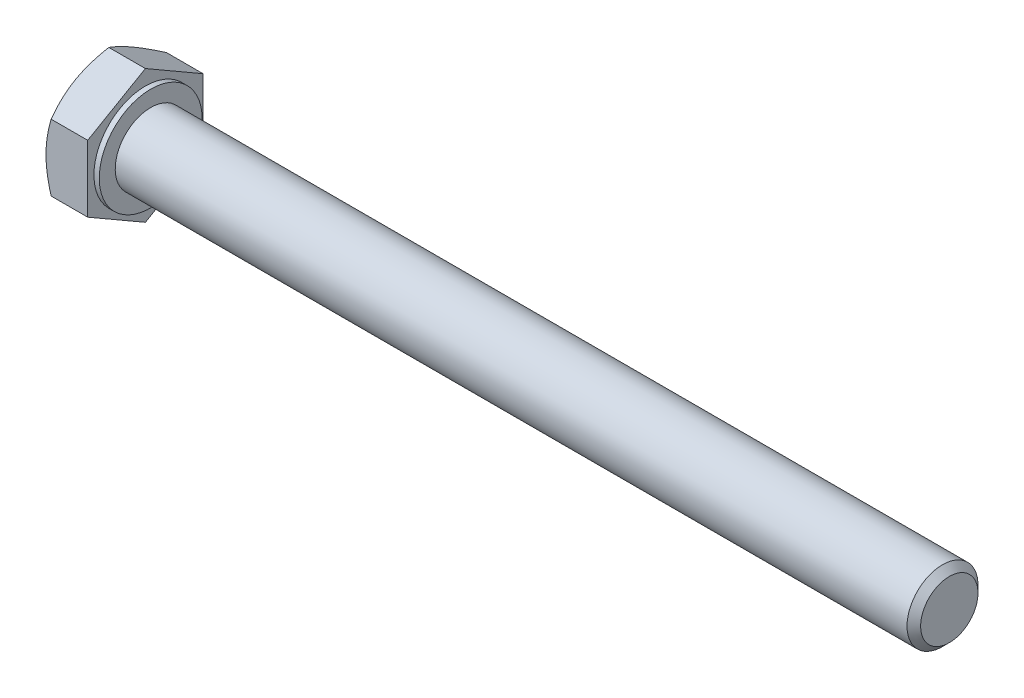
ISO-10303-21;
HEADER;
FILE_DESCRIPTION(('STEP AP214'),'2;1');
FILE_NAME('part.step','',(''),(''),'','','');
FILE_SCHEMA(('AUTOMOTIVE_DESIGN { 1 0 10303 214 1 1 1 1 }'));
ENDSEC;
DATA;
#1=APPLICATION_CONTEXT('core data for automotive mechanical design processes');
#2=APPLICATION_PROTOCOL_DEFINITION('international standard','automotive_design',2000,#1);
#3=PRODUCT_CONTEXT('',#1,'mechanical');
#4=PRODUCT('Part','Part','',(#3));
#5=PRODUCT_RELATED_PRODUCT_CATEGORY('part','',(#4));
#6=PRODUCT_DEFINITION_FORMATION('','',#4);
#7=PRODUCT_DEFINITION_CONTEXT('part definition',#1,'design');
#8=PRODUCT_DEFINITION('design','',#6,#7);
#9=PRODUCT_DEFINITION_SHAPE('','',#8);
#10=(LENGTH_UNIT() NAMED_UNIT(*) SI_UNIT(.MILLI.,.METRE.));
#11=(NAMED_UNIT(*) PLANE_ANGLE_UNIT() SI_UNIT($,.RADIAN.));
#12=(NAMED_UNIT(*) SI_UNIT($,.STERADIAN.) SOLID_ANGLE_UNIT());
#13=UNCERTAINTY_MEASURE_WITH_UNIT(LENGTH_MEASURE(1.E-05),#10,'distance_accuracy_value','');
#14=(GEOMETRIC_REPRESENTATION_CONTEXT(3) GLOBAL_UNCERTAINTY_ASSIGNED_CONTEXT((#13)) GLOBAL_UNIT_ASSIGNED_CONTEXT((#10,
#11,#12)) REPRESENTATION_CONTEXT('',''));
#15=CARTESIAN_POINT('',(0.,0.,0.));
#16=DIRECTION('',(0.,0.,1.));
#17=DIRECTION('',(1.,0.,0.));
#18=AXIS2_PLACEMENT_3D('',#15,#16,#17);
#19=CARTESIAN_POINT('',(-5.30009999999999,0.,0.));
#20=DIRECTION('',(1.,0.,0.));
#21=DIRECTION('',(0.,0.,-1.));
#22=AXIS2_PLACEMENT_3D('',#19,#20,#21);
#23=PLANE('',#22);
#24=CARTESIAN_POINT('',(-5.30010000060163,0.,0.));
#25=DIRECTION('',(1.,0.,0.));
#26=DIRECTION('',(0.,0.,-1.));
#27=AXIS2_PLACEMENT_3D('',#24,#25,#26);
#28=CIRCLE('',#27,6.50000000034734);
#29=CARTESIAN_POINT('',(-5.3001000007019,5.62916512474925,-3.25000000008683));
#30=VERTEX_POINT('',#29);
#31=CARTESIAN_POINT('',(-5.3001000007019,5.62916512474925,3.25000000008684));
#32=VERTEX_POINT('',#31);
#33=EDGE_CURVE('E323',#30,#32,#28,.T.);
#34=ORIENTED_EDGE('',*,*,#33,.F.);
#35=CARTESIAN_POINT('',(-5.30010000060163,0.,0.));
#36=DIRECTION('',(1.,0.,0.));
#37=DIRECTION('',(0.,0.,-1.));
#38=AXIS2_PLACEMENT_3D('',#35,#36,#37);
#39=CIRCLE('',#38,6.50000000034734);
#40=CARTESIAN_POINT('',(-5.3001000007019,0.,-6.50000000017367));
#41=VERTEX_POINT('',#40);
#42=EDGE_CURVE('E319',#41,#30,#39,.T.);
#43=ORIENTED_EDGE('',*,*,#42,.F.);
#44=CARTESIAN_POINT('',(-5.30010000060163,0.,0.));
#45=DIRECTION('',(1.,0.,0.));
#46=DIRECTION('',(0.,0.,-1.));
#47=AXIS2_PLACEMENT_3D('',#44,#45,#46);
#48=CIRCLE('',#47,6.50000000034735);
#49=CARTESIAN_POINT('',(-5.3001000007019,-5.62916512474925,-3.25000000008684));
#50=VERTEX_POINT('',#49);
#51=EDGE_CURVE('E315',#50,#41,#48,.T.);
#52=ORIENTED_EDGE('',*,*,#51,.F.);
#53=CARTESIAN_POINT('',(-5.30010000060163,0.,0.));
#54=DIRECTION('',(1.,0.,0.));
#55=DIRECTION('',(0.,0.,-1.));
#56=AXIS2_PLACEMENT_3D('',#53,#54,#55);
#57=CIRCLE('',#56,6.50000000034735);
#58=CARTESIAN_POINT('',(-5.3001000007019,-5.62916512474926,3.25000000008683));
#59=VERTEX_POINT('',#58);
#60=EDGE_CURVE('E90',#59,#50,#57,.T.);
#61=ORIENTED_EDGE('',*,*,#60,.F.);
#62=CARTESIAN_POINT('',(-5.30010000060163,0.,0.));
#63=DIRECTION('',(1.,0.,0.));
#64=DIRECTION('',(0.,0.,-1.));
#65=AXIS2_PLACEMENT_3D('',#62,#63,#64);
#66=CIRCLE('',#65,6.50000000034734);
#67=CARTESIAN_POINT('',(-5.3001000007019,0.,6.50000000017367));
#68=VERTEX_POINT('',#67);
#69=EDGE_CURVE('E87',#68,#59,#66,.T.);
#70=ORIENTED_EDGE('',*,*,#69,.F.);
#71=CARTESIAN_POINT('',(-5.30010000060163,0.,0.));
#72=DIRECTION('',(1.,0.,0.));
#73=DIRECTION('',(0.,0.,-1.));
#74=AXIS2_PLACEMENT_3D('',#71,#72,#73);
#75=CIRCLE('',#74,6.50000000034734);
#76=EDGE_CURVE('E19',#32,#68,#75,.T.);
#77=ORIENTED_EDGE('',*,*,#76,.F.);
#78=EDGE_LOOP('',(#34,#43,#52,#61,#70,#77));
#79=FACE_BOUND('',#78,.T.);
#80=ADVANCED_FACE('F16',(#79),#23,.F.);
#81=CARTESIAN_POINT('',(-4.71606007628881,0.,0.));
#82=DIRECTION('',(1.,0.,0.));
#83=DIRECTION('',(0.,0.,-1.));
#84=AXIS2_PLACEMENT_3D('',#81,#82,#83);
#85=CONICAL_SURFACE('',#84,7.51158682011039,1.04719755);
#86=ORIENTED_EDGE('',*,*,#76,.T.);
#87=CARTESIAN_POINT('',(-4.71954341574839,3.75277674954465,6.50000000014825));
#88=CARTESIAN_POINT('',(-4.80774841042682,3.44730232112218,6.50000000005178));
#89=CARTESIAN_POINT('',(-4.88855958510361,3.13938154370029,6.50000000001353));
#90=CARTESIAN_POINT('',(-5.03106863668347,2.52082569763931,6.49999999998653));
#91=CARTESIAN_POINT('',(-5.09286102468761,2.2102122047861,6.49999999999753));
#92=CARTESIAN_POINT('',(-5.16873158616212,1.74136052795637,6.50000000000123));
#93=CARTESIAN_POINT('',(-5.19122798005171,1.58448437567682,6.50000000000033));
#94=CARTESIAN_POINT('',(-5.23016970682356,1.26998104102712,6.49999999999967));
#95=CARTESIAN_POINT('',(-5.24661519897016,1.11235387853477,6.4999999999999));
#96=CARTESIAN_POINT('',(-5.27316617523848,0.795765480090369,6.50000000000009));
#97=CARTESIAN_POINT('',(-5.28323941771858,0.636801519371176,6.50000000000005));
#98=CARTESIAN_POINT('',(-5.29672027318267,0.31856096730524,6.49999999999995));
#99=CARTESIAN_POINT('',(-5.30012656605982,0.159284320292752,6.4999999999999));
#100=CARTESIAN_POINT('',(-5.30010000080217,1.44683826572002E-11,6.5));
#101=B_SPLINE_CURVE_WITH_KNOTS('',3,(#87,#88,#89,#90,#91,#92,#93,#94,#95,#96,#97,#98,#99,#100),
.UNSPECIFIED.,.F.,.F.,(4,2,2,2,2,2,4),(0.,0.95424765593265,1.90367376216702,2.37900973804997,
2.85433320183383,3.33204281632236,3.80984701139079),.UNSPECIFIED.);
#102=CARTESIAN_POINT('',(-4.71954341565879,3.75277674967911,6.49999999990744));
#103=VERTEX_POINT('',#102);
#104=EDGE_CURVE('E108',#103,#68,#101,.T.);
#105=ORIENTED_EDGE('',*,*,#104,.F.);
#106=CARTESIAN_POINT('',(-5.30010000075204,5.62916512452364,3.24999999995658));
#107=CARTESIAN_POINT('',(-5.30012656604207,5.54952296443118,3.38794426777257));
#108=CARTESIAN_POINT('',(-5.29672027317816,5.4698846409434,3.52588189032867));
#109=CARTESIAN_POINT('',(-5.28323941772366,5.31076436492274,3.80148629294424));
#110=CARTESIAN_POINT('',(-5.27316617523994,5.231282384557,3.93915312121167));
#111=CARTESIAN_POINT('',(-5.24661519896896,5.07298818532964,4.21332671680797));
#112=CARTESIAN_POINT('',(-5.23016970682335,4.99417460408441,4.34983584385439));
#113=CARTESIAN_POINT('',(-5.19122798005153,4.8369229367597,4.62220372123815));
#114=CARTESIAN_POINT('',(-5.16873158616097,4.75848486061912,4.75806245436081));
#115=CARTESIAN_POINT('',(-5.09286102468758,4.52405902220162,5.16409991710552));
#116=CARTESIAN_POINT('',(-5.03106863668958,4.36875227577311,5.43309909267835));
#117=CARTESIAN_POINT('',(-4.88855958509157,4.059474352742,5.96878416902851));
#118=CARTESIAN_POINT('',(-4.80774841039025,3.90551396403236,6.23545138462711));
#119=CARTESIAN_POINT('',(-4.71954341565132,3.7527767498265,6.49999999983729));
#120=B_SPLINE_CURVE_WITH_KNOTS('',3,(#106,#107,#108,#109,#110,#111,#112,#113,#114,#115,#116,
#117,#118,#119),.UNSPECIFIED.,.F.,.F.,(4,2,2,2,2,2,4),(0.,0.477804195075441,0.955513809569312,
1.43083727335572,1.90617324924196,2.85559935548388,3.80984701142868),.UNSPECIFIED.);
#121=EDGE_CURVE('E102',#32,#103,#120,.T.);
#122=ORIENTED_EDGE('',*,*,#121,.F.);
#123=EDGE_LOOP('',(#86,#105,#122));
#124=FACE_BOUND('',#123,.T.);
#125=ADVANCED_FACE('F107',(#124),#85,.T.);
#126=CARTESIAN_POINT('',(-4.71606007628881,0.,0.));
#127=DIRECTION('',(1.,0.,0.));
#128=DIRECTION('',(0.,0.,-1.));
#129=AXIS2_PLACEMENT_3D('',#126,#127,#128);
#130=CONICAL_SURFACE('',#129,7.51158682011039,1.04719755);
#131=CARTESIAN_POINT('',(-5.30010000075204,0.,6.49999999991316));
#132=CARTESIAN_POINT('',(-5.30012656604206,-0.159284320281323,6.49999999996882));
#133=CARTESIAN_POINT('',(-5.29672027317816,-0.318560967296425,6.49999999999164));
#134=CARTESIAN_POINT('',(-5.28323941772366,-0.636801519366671,6.50000000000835));
#135=CARTESIAN_POINT('',(-5.27316617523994,-0.795765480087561,6.50000000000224));
#136=CARTESIAN_POINT('',(-5.24661519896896,-1.11235387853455,6.49999999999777));
#137=CARTESIAN_POINT('',(-5.23016970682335,-1.26998104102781,6.49999999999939));
#138=CARTESIAN_POINT('',(-5.19122798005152,-1.58448437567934,6.50000000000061));
#139=CARTESIAN_POINT('',(-5.16873158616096,-1.74136052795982,6.50000000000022));
#140=CARTESIAN_POINT('',(-5.09286102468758,-2.21021220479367,6.49999999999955));
#141=CARTESIAN_POINT('',(-5.03106863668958,-2.52082569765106,6.49999999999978));
#142=CARTESIAN_POINT('',(-4.88855958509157,-3.13938154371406,6.50000000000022));
#143=CARTESIAN_POINT('',(-4.80774841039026,-3.44730232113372,6.50000000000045));
#144=CARTESIAN_POINT('',(-4.71954341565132,-3.75277674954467,6.5));
#145=B_SPLINE_CURVE_WITH_KNOTS('',3,(#131,#132,#133,#134,#135,#136,#137,#138,#139,#140,#141,
#142,#143,#144),.UNSPECIFIED.,.F.,.F.,(4,2,2,2,2,2,4),(0.,0.477804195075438,0.955513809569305,
1.43083727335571,1.90617324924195,2.85559935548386,3.80984701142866),.UNSPECIFIED.);
#146=CARTESIAN_POINT('',(-4.71954341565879,-3.75277674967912,6.49999999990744));
#147=VERTEX_POINT('',#146);
#148=EDGE_CURVE('E95',#68,#147,#145,.T.);
#149=ORIENTED_EDGE('',*,*,#148,.F.);
#150=ORIENTED_EDGE('',*,*,#69,.T.);
#151=CARTESIAN_POINT('',(-4.71954341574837,-3.75277674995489,6.49999999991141));
#152=CARTESIAN_POINT('',(-4.80774841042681,-3.90551396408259,6.23545138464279));
#153=CARTESIAN_POINT('',(-4.8885595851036,-4.05947435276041,5.96878416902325));
#154=CARTESIAN_POINT('',(-5.03106863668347,-4.36875227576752,5.43309909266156));
#155=CARTESIAN_POINT('',(-5.09286102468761,-4.52405902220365,5.16409991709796));
#156=CARTESIAN_POINT('',(-5.16873158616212,-4.75848486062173,4.75806245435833));
#157=CARTESIAN_POINT('',(-5.19122798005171,-4.83692293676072,4.62220372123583));
#158=CARTESIAN_POINT('',(-5.23016970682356,-4.99417460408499,4.34983584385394));
#159=CARTESIAN_POINT('',(-5.24661519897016,-5.07298818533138,4.21332671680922));
#160=CARTESIAN_POINT('',(-5.27316617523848,-5.23128238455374,3.93915312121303));
#161=CARTESIAN_POINT('',(-5.28323941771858,-5.3107643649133,3.80148629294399));
#162=CARTESIAN_POINT('',(-5.29672027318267,-5.46988464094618,3.52588189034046));
#163=CARTESIAN_POINT('',(-5.30012656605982,-5.54952296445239,3.38794426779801));
#164=CARTESIAN_POINT('',(-5.30010000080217,-5.62916512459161,3.25000000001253));
#165=B_SPLINE_CURVE_WITH_KNOTS('',3,(#151,#152,#153,#154,#155,#156,#157,#158,#159,#160,#161,
#162,#163,#164),.UNSPECIFIED.,.F.,.F.,(4,2,2,2,2,2,4),(0.,0.954247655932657,1.90367376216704,
2.37900973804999,2.85433320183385,3.33204281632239,3.80984701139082),.UNSPECIFIED.);
#166=EDGE_CURVE('E97',#147,#59,#165,.T.);
#167=ORIENTED_EDGE('',*,*,#166,.F.);
#168=EDGE_LOOP('',(#149,#150,#167));
#169=FACE_BOUND('',#168,.T.);
#170=ADVANCED_FACE('F96',(#169),#130,.T.);
#171=CARTESIAN_POINT('',(-4.71606007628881,0.,0.));
#172=DIRECTION('',(1.,0.,0.));
#173=DIRECTION('',(0.,0.,-1.));
#174=AXIS2_PLACEMENT_3D('',#171,#172,#173);
#175=CONICAL_SURFACE('',#174,7.51158682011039,1.04719755);
#176=CARTESIAN_POINT('',(-5.30010000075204,-5.62916512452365,3.24999999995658));
#177=CARTESIAN_POINT('',(-5.30012656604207,-5.7088072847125,3.11205573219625));
#178=CARTESIAN_POINT('',(-5.29672027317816,-5.78844560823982,2.97411810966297));
#179=CARTESIAN_POINT('',(-5.28323941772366,-5.94756588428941,2.69851370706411));
#180=CARTESIAN_POINT('',(-5.27316617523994,-6.02704786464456,2.56084687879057));
#181=CARTESIAN_POINT('',(-5.24661519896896,-6.18534206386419,2.28667328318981));
#182=CARTESIAN_POINT('',(-5.23016970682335,-6.26415564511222,2.150164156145));
#183=CARTESIAN_POINT('',(-5.19122798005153,-6.42140731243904,1.87779627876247));
#184=CARTESIAN_POINT('',(-5.16873158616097,-6.49984538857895,1.74193754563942));
#185=CARTESIAN_POINT('',(-5.09286102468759,-6.7342712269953,1.33590008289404));
#186=CARTESIAN_POINT('',(-5.03106863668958,-6.88957797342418,1.06690090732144));
#187=CARTESIAN_POINT('',(-4.88855958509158,-7.19885589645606,0.531215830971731));
#188=CARTESIAN_POINT('',(-4.80774841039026,-7.35281628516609,0.264548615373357));
#189=CARTESIAN_POINT('',(-4.71954341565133,-7.50555349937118,1.6272616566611E-10));
#190=B_SPLINE_CURVE_WITH_KNOTS('',3,(#176,#177,#178,#179,#180,#181,#182,#183,#184,#185,#186,
#187,#188,#189),.UNSPECIFIED.,.F.,.F.,(4,2,2,2,2,2,4),(0.,0.477804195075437,0.955513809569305,
1.43083727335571,1.90617324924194,2.85559935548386,3.80984701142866),.UNSPECIFIED.);
#191=CARTESIAN_POINT('',(-4.71954341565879,-7.50555349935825,0.));
#192=VERTEX_POINT('',#191);
#193=EDGE_CURVE('E113',#59,#192,#190,.T.);
#194=ORIENTED_EDGE('',*,*,#193,.F.);
#195=ORIENTED_EDGE('',*,*,#60,.T.);
#196=CARTESIAN_POINT('',(-4.71954341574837,-7.50555349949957,-2.36832132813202E-10));
#197=CARTESIAN_POINT('',(-4.80774841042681,-7.3528162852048,-0.264548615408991));
#198=CARTESIAN_POINT('',(-4.8885595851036,-7.19885589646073,-0.531215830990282));
#199=CARTESIAN_POINT('',(-5.03106863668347,-6.88957797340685,-1.06690090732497));
#200=CARTESIAN_POINT('',(-5.09286102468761,-6.73427122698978,-1.33590008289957));
#201=CARTESIAN_POINT('',(-5.16873158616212,-6.49984538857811,-1.7419375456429));
#202=CARTESIAN_POINT('',(-5.19122798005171,-6.42140731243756,-1.8777962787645));
#203=CARTESIAN_POINT('',(-5.23016970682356,-6.26415564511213,-2.15016415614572));
#204=CARTESIAN_POINT('',(-5.24661519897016,-6.18534206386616,-2.28667328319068));
#205=CARTESIAN_POINT('',(-5.27316617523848,-6.02704786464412,-2.56084687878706));
#206=CARTESIAN_POINT('',(-5.28323941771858,-5.94756588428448,-2.69851370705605));
#207=CARTESIAN_POINT('',(-5.29672027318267,-5.78844560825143,-2.97411810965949));
#208=CARTESIAN_POINT('',(-5.30012656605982,-5.70880728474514,-3.11205573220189));
#209=CARTESIAN_POINT('',(-5.30010000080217,-5.62916512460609,-3.24999999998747));
#210=B_SPLINE_CURVE_WITH_KNOTS('',3,(#196,#197,#198,#199,#200,#201,#202,#203,#204,#205,#206,
#207,#208,#209),.UNSPECIFIED.,.F.,.F.,(4,2,2,2,2,2,4),(0.,0.954247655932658,1.90367376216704,
2.37900973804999,2.85433320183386,3.33204281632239,3.80984701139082),.UNSPECIFIED.);
#211=EDGE_CURVE('E207',#192,#50,#210,.T.);
#212=ORIENTED_EDGE('',*,*,#211,.F.);
#213=EDGE_LOOP('',(#194,#195,#212));
#214=FACE_BOUND('',#213,.T.);
#215=ADVANCED_FACE('F215',(#214),#175,.T.);
#216=CARTESIAN_POINT('',(-4.71606007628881,0.,0.));
#217=DIRECTION('',(1.,0.,0.));
#218=DIRECTION('',(0.,0.,-1.));
#219=AXIS2_PLACEMENT_3D('',#216,#217,#218);
#220=CONICAL_SURFACE('',#219,7.51158682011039,1.04719755);
#221=CARTESIAN_POINT('',(-5.30010000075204,-5.62916512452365,-3.24999999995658));
#222=CARTESIAN_POINT('',(-5.30012656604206,-5.54952296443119,-3.38794426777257));
#223=CARTESIAN_POINT('',(-5.29672027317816,-5.46988464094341,-3.52588189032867));
#224=CARTESIAN_POINT('',(-5.28323941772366,-5.31076436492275,-3.80148629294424));
#225=CARTESIAN_POINT('',(-5.27316617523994,-5.23128238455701,-3.93915312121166));
#226=CARTESIAN_POINT('',(-5.24661519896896,-5.07298818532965,-4.21332671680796));
#227=CARTESIAN_POINT('',(-5.23016970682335,-4.99417460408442,-4.34983584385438));
#228=CARTESIAN_POINT('',(-5.19122798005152,-4.83692293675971,-4.62220372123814));
#229=CARTESIAN_POINT('',(-5.16873158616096,-4.75848486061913,-4.7580624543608));
#230=CARTESIAN_POINT('',(-5.09286102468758,-4.52405902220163,-5.16409991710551));
#231=CARTESIAN_POINT('',(-5.03106863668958,-4.36875227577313,-5.43309909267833));
#232=CARTESIAN_POINT('',(-4.88855958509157,-4.05947435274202,-5.96878416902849));
#233=CARTESIAN_POINT('',(-4.80774841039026,-3.90551396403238,-6.23545138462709));
#234=CARTESIAN_POINT('',(-4.71954341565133,-3.75277674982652,-6.49999999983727));
#235=B_SPLINE_CURVE_WITH_KNOTS('',3,(#221,#222,#223,#224,#225,#226,#227,#228,#229,#230,#231,
#232,#233,#234),.UNSPECIFIED.,.F.,.F.,(4,2,2,2,2,2,4),(0.,0.477804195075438,0.955513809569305,
1.43083727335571,1.90617324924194,2.85559935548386,3.80984701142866),.UNSPECIFIED.);
#236=CARTESIAN_POINT('',(-4.71954341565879,-3.75277674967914,-6.49999999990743));
#237=VERTEX_POINT('',#236);
#238=EDGE_CURVE('E219',#50,#237,#235,.T.);
#239=ORIENTED_EDGE('',*,*,#238,.F.);
#240=ORIENTED_EDGE('',*,*,#51,.T.);
#241=CARTESIAN_POINT('',(-4.71954341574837,-3.75277674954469,-6.50000000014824));
#242=CARTESIAN_POINT('',(-4.8077484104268,-3.44730232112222,-6.50000000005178));
#243=CARTESIAN_POINT('',(-4.8885595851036,-3.13938154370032,-6.50000000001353));
#244=CARTESIAN_POINT('',(-5.03106863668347,-2.52082569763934,-6.49999999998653));
#245=CARTESIAN_POINT('',(-5.09286102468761,-2.21021220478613,-6.49999999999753));
#246=CARTESIAN_POINT('',(-5.16873158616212,-1.74136052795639,-6.50000000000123));
#247=CARTESIAN_POINT('',(-5.19122798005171,-1.58448437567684,-6.50000000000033));
#248=CARTESIAN_POINT('',(-5.23016970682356,-1.26998104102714,-6.49999999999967));
#249=CARTESIAN_POINT('',(-5.24661519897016,-1.11235387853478,-6.4999999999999));
#250=CARTESIAN_POINT('',(-5.27316617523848,-0.795765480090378,-6.50000000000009));
#251=CARTESIAN_POINT('',(-5.28323941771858,-0.636801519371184,-6.50000000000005));
#252=CARTESIAN_POINT('',(-5.29672027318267,-0.318560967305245,-6.49999999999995));
#253=CARTESIAN_POINT('',(-5.30012656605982,-0.159284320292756,-6.4999999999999));
#254=CARTESIAN_POINT('',(-5.30010000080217,-1.4470694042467E-11,-6.5));
#255=B_SPLINE_CURVE_WITH_KNOTS('',3,(#241,#242,#243,#244,#245,#246,#247,#248,#249,#250,#251,
#252,#253,#254),.UNSPECIFIED.,.F.,.F.,(4,2,2,2,2,2,4),(0.,0.954247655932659,1.90367376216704,
2.37900973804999,2.85433320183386,3.3320428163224,3.80984701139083),.UNSPECIFIED.);
#256=EDGE_CURVE('E201',#237,#41,#255,.T.);
#257=ORIENTED_EDGE('',*,*,#256,.F.);
#258=EDGE_LOOP('',(#239,#240,#257));
#259=FACE_BOUND('',#258,.T.);
#260=ADVANCED_FACE('F212',(#259),#220,.T.);
#261=CARTESIAN_POINT('',(-4.71606007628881,0.,0.));
#262=DIRECTION('',(1.,0.,0.));
#263=DIRECTION('',(0.,0.,-1.));
#264=AXIS2_PLACEMENT_3D('',#261,#262,#263);
#265=CONICAL_SURFACE('',#264,7.51158682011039,1.04719755);
#266=ORIENTED_EDGE('',*,*,#42,.T.);
#267=CARTESIAN_POINT('',(-4.71954341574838,3.75277674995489,-6.49999999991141));
#268=CARTESIAN_POINT('',(-4.80774841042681,3.90551396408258,-6.23545138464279));
#269=CARTESIAN_POINT('',(-4.8885595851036,4.05947435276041,-5.96878416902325));
#270=CARTESIAN_POINT('',(-5.03106863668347,4.36875227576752,-5.43309909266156));
#271=CARTESIAN_POINT('',(-5.09286102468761,4.52405902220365,-5.16409991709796));
#272=CARTESIAN_POINT('',(-5.16873158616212,4.75848486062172,-4.75806245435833));
#273=CARTESIAN_POINT('',(-5.19122798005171,4.83692293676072,-4.62220372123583));
#274=CARTESIAN_POINT('',(-5.23016970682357,4.99417460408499,-4.34983584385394));
#275=CARTESIAN_POINT('',(-5.24661519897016,5.07298818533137,-4.21332671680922));
#276=CARTESIAN_POINT('',(-5.27316617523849,5.23128238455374,-3.93915312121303));
#277=CARTESIAN_POINT('',(-5.28323941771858,5.3107643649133,-3.80148629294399));
#278=CARTESIAN_POINT('',(-5.29672027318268,5.46988464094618,-3.52588189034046));
#279=CARTESIAN_POINT('',(-5.30012656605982,5.54952296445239,-3.38794426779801));
#280=CARTESIAN_POINT('',(-5.30010000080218,5.62916512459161,-3.25000000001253));
#281=B_SPLINE_CURVE_WITH_KNOTS('',3,(#267,#268,#269,#270,#271,#272,#273,#274,#275,#276,#277,
#278,#279,#280),.UNSPECIFIED.,.F.,.F.,(4,2,2,2,2,2,4),(0.,0.954247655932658,1.90367376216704,
2.37900973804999,2.85433320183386,3.3320428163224,3.80984701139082),.UNSPECIFIED.);
#282=CARTESIAN_POINT('',(-4.71954341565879,3.75277674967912,-6.49999999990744));
#283=VERTEX_POINT('',#282);
#284=EDGE_CURVE('E173',#283,#30,#281,.T.);
#285=ORIENTED_EDGE('',*,*,#284,.F.);
#286=CARTESIAN_POINT('',(-5.30010000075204,0.,-6.49999999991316));
#287=CARTESIAN_POINT('',(-5.30012656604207,0.15928432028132,-6.49999999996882));
#288=CARTESIAN_POINT('',(-5.29672027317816,0.318560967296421,-6.49999999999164));
#289=CARTESIAN_POINT('',(-5.28323941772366,0.636801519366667,-6.50000000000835));
#290=CARTESIAN_POINT('',(-5.27316617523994,0.795765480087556,-6.50000000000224));
#291=CARTESIAN_POINT('',(-5.24661519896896,1.11235387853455,-6.49999999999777));
#292=CARTESIAN_POINT('',(-5.23016970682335,1.26998104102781,-6.49999999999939));
#293=CARTESIAN_POINT('',(-5.19122798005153,1.58448437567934,-6.50000000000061));
#294=CARTESIAN_POINT('',(-5.16873158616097,1.74136052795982,-6.50000000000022));
#295=CARTESIAN_POINT('',(-5.09286102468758,2.21021220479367,-6.49999999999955));
#296=CARTESIAN_POINT('',(-5.03106863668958,2.52082569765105,-6.49999999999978));
#297=CARTESIAN_POINT('',(-4.88855958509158,3.13938154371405,-6.50000000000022));
#298=CARTESIAN_POINT('',(-4.80774841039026,3.44730232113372,-6.50000000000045));
#299=CARTESIAN_POINT('',(-4.71954341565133,3.75277674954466,-6.5));
#300=B_SPLINE_CURVE_WITH_KNOTS('',3,(#286,#287,#288,#289,#290,#291,#292,#293,#294,#295,#296,
#297,#298,#299),.UNSPECIFIED.,.F.,.F.,(4,2,2,2,2,2,4),(0.,0.477804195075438,0.955513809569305,
1.43083727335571,1.90617324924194,2.85559935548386,3.80984701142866),.UNSPECIFIED.);
#301=EDGE_CURVE('E196',#41,#283,#300,.T.);
#302=ORIENTED_EDGE('',*,*,#301,.F.);
#303=EDGE_LOOP('',(#266,#285,#302));
#304=FACE_BOUND('',#303,.T.);
#305=ADVANCED_FACE('F158',(#304),#265,.T.);
#306=CARTESIAN_POINT('',(-4.71606007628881,0.,0.));
#307=DIRECTION('',(1.,0.,0.));
#308=DIRECTION('',(0.,0.,-1.));
#309=AXIS2_PLACEMENT_3D('',#306,#307,#308);
#310=CONICAL_SURFACE('',#309,7.51158682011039,1.04719755);
#311=ORIENTED_EDGE('',*,*,#33,.T.);
#312=CARTESIAN_POINT('',(-4.71954341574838,7.50555349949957,2.36845423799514E-10));
#313=CARTESIAN_POINT('',(-4.80774841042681,7.3528162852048,0.264548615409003));
#314=CARTESIAN_POINT('',(-4.8885595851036,7.19885589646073,0.531215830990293));
#315=CARTESIAN_POINT('',(-5.03106863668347,6.88957797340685,1.06690090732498));
#316=CARTESIAN_POINT('',(-5.09286102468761,6.73427122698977,1.33590008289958));
#317=CARTESIAN_POINT('',(-5.16873158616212,6.49984538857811,1.74193754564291));
#318=CARTESIAN_POINT('',(-5.19122798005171,6.42140731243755,1.8777962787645));
#319=CARTESIAN_POINT('',(-5.23016970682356,6.26415564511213,2.15016415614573));
#320=CARTESIAN_POINT('',(-5.24661519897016,6.18534206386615,2.28667328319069));
#321=CARTESIAN_POINT('',(-5.27316617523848,6.02704786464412,2.56084687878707));
#322=CARTESIAN_POINT('',(-5.28323941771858,5.94756588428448,2.69851370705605));
#323=CARTESIAN_POINT('',(-5.29672027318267,5.78844560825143,2.97411810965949));
#324=CARTESIAN_POINT('',(-5.30012656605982,5.70880728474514,3.11205573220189));
#325=CARTESIAN_POINT('',(-5.30010000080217,5.62916512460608,3.24999999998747));
#326=B_SPLINE_CURVE_WITH_KNOTS('',3,(#312,#313,#314,#315,#316,#317,#318,#319,#320,#321,#322,
#323,#324,#325),.UNSPECIFIED.,.F.,.F.,(4,2,2,2,2,2,4),(0.,0.954247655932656,1.90367376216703,
2.37900973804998,2.85433320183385,3.33204281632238,3.80984701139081),.UNSPECIFIED.);
#327=CARTESIAN_POINT('',(-4.71954341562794,7.50555349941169,9.25589075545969E-11));
#328=VERTEX_POINT('',#327);
#329=EDGE_CURVE('E143',#328,#32,#326,.T.);
#330=ORIENTED_EDGE('',*,*,#329,.F.);
#331=CARTESIAN_POINT('',(-5.30010000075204,5.62916512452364,-3.24999999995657));
#332=CARTESIAN_POINT('',(-5.30012656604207,5.7088072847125,-3.11205573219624));
#333=CARTESIAN_POINT('',(-5.29672027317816,5.78844560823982,-2.97411810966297));
#334=CARTESIAN_POINT('',(-5.28323941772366,5.94756588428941,-2.69851370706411));
#335=CARTESIAN_POINT('',(-5.27316617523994,6.02704786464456,-2.56084687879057));
#336=CARTESIAN_POINT('',(-5.24661519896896,6.1853420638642,-2.28667328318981));
#337=CARTESIAN_POINT('',(-5.23016970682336,6.26415564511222,-2.150164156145));
#338=CARTESIAN_POINT('',(-5.19122798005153,6.42140731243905,-1.87779627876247));
#339=CARTESIAN_POINT('',(-5.16873158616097,6.49984538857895,-1.74193754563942));
#340=CARTESIAN_POINT('',(-5.09286102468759,6.7342712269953,-1.33590008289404));
#341=CARTESIAN_POINT('',(-5.03106863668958,6.88957797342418,-1.06690090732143));
#342=CARTESIAN_POINT('',(-4.88855958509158,7.19885589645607,-0.531215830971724));
#343=CARTESIAN_POINT('',(-4.80774841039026,7.3528162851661,-0.264548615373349));
#344=CARTESIAN_POINT('',(-4.71954341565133,7.50555349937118,-1.62717065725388E-10));
#345=B_SPLINE_CURVE_WITH_KNOTS('',3,(#331,#332,#333,#334,#335,#336,#337,#338,#339,#340,#341,
#342,#343,#344),.UNSPECIFIED.,.F.,.F.,(4,2,2,2,2,2,4),(0.,0.477804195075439,0.955513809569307,
1.43083727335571,1.90617324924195,2.85559935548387,3.80984701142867),.UNSPECIFIED.);
#346=EDGE_CURVE('E164',#30,#328,#345,.T.);
#347=ORIENTED_EDGE('',*,*,#346,.F.);
#348=EDGE_LOOP('',(#311,#330,#347));
#349=FACE_BOUND('',#348,.T.);
#350=ADVANCED_FACE('F152',(#349),#310,.T.);
#351=CARTESIAN_POINT('',(-0.600099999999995,7.50555349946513,0.));
#352=DIRECTION('',(0.,0.866025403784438,0.500000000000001));
#353=DIRECTION('',(0.,-0.500000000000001,0.866025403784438));
#354=AXIS2_PLACEMENT_3D('',#351,#352,#353);
#355=PLANE('',#354);
#356=DIRECTION('',(0.,-0.500000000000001,0.866025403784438));
#357=VECTOR('',#356,1.);
#358=CARTESIAN_POINT('',(-0.600099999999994,7.50555349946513,0.));
#359=LINE('',#358,#357);
#360=CARTESIAN_POINT('',(-0.600099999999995,7.50555349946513,0.));
#361=VERTEX_POINT('',#360);
#362=CARTESIAN_POINT('',(-0.600099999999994,3.75277674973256,6.5));
#363=VERTEX_POINT('',#362);
#364=EDGE_CURVE('E284',#361,#363,#359,.T.);
#365=ORIENTED_EDGE('',*,*,#364,.F.);
#366=DIRECTION('',(1.,0.,0.));
#367=VECTOR('',#366,1.);
#368=CARTESIAN_POINT('',(-0.600099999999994,7.50555349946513,0.));
#369=LINE('',#368,#367);
#370=EDGE_CURVE('E172',#328,#361,#369,.T.);
#371=ORIENTED_EDGE('',*,*,#370,.F.);
#372=ORIENTED_EDGE('',*,*,#329,.T.);
#373=ORIENTED_EDGE('',*,*,#121,.T.);
#374=DIRECTION('',(1.,0.,0.));
#375=VECTOR('',#374,1.);
#376=CARTESIAN_POINT('',(-0.600099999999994,3.75277674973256,6.5));
#377=LINE('',#376,#375);
#378=EDGE_CURVE('E101',#363,#103,#377,.F.);
#379=ORIENTED_EDGE('',*,*,#378,.F.);
#380=EDGE_LOOP('',(#365,#371,#372,#373,#379));
#381=FACE_BOUND('',#380,.T.);
#382=ADVANCED_FACE('F149',(#381),#355,.T.);
#383=CARTESIAN_POINT('',(-0.600099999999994,3.75277674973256,6.5));
#384=DIRECTION('',(0.,0.,1.));
#385=DIRECTION('',(1.,0.,0.));
#386=AXIS2_PLACEMENT_3D('',#383,#384,#385);
#387=PLANE('',#386);
#388=ORIENTED_EDGE('',*,*,#378,.T.);
#389=ORIENTED_EDGE('',*,*,#104,.T.);
#390=ORIENTED_EDGE('',*,*,#148,.T.);
#391=DIRECTION('',(1.,0.,0.));
#392=VECTOR('',#391,1.);
#393=CARTESIAN_POINT('',(-0.600099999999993,-3.75277674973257,6.49999999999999));
#394=LINE('',#393,#392);
#395=CARTESIAN_POINT('',(-0.600099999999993,-3.75277674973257,6.5));
#396=VERTEX_POINT('',#395);
#397=EDGE_CURVE('E115',#396,#147,#394,.F.);
#398=ORIENTED_EDGE('',*,*,#397,.F.);
#399=DIRECTION('',(0.,1.,0.));
#400=VECTOR('',#399,1.);
#401=CARTESIAN_POINT('',(-0.600099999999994,0.,6.5));
#402=LINE('',#401,#400);
#403=EDGE_CURVE('E280',#363,#396,#402,.F.);
#404=ORIENTED_EDGE('',*,*,#403,.F.);
#405=EDGE_LOOP('',(#388,#389,#390,#398,#404));
#406=FACE_BOUND('',#405,.T.);
#407=ADVANCED_FACE('F111',(#406),#387,.T.);
#408=CARTESIAN_POINT('',(-0.600099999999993,-3.75277674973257,6.49999999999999));
#409=DIRECTION('',(0.,-0.866025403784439,0.499999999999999));
#410=DIRECTION('',(0.,-0.499999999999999,-0.866025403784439));
#411=AXIS2_PLACEMENT_3D('',#408,#409,#410);
#412=PLANE('',#411);
#413=ORIENTED_EDGE('',*,*,#397,.T.);
#414=ORIENTED_EDGE('',*,*,#166,.T.);
#415=ORIENTED_EDGE('',*,*,#193,.T.);
#416=DIRECTION('',(1.,0.,0.));
#417=VECTOR('',#416,1.);
#418=CARTESIAN_POINT('',(-0.600099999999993,-7.50555349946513,0.));
#419=LINE('',#418,#417);
#420=CARTESIAN_POINT('',(-0.600099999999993,-7.50555349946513,0.));
#421=VERTEX_POINT('',#420);
#422=EDGE_CURVE('E224',#421,#192,#419,.F.);
#423=ORIENTED_EDGE('',*,*,#422,.F.);
#424=DIRECTION('',(0.,-0.499999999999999,-0.866025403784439));
#425=VECTOR('',#424,1.);
#426=CARTESIAN_POINT('',(-0.600099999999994,-3.75277674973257,6.49999999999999));
#427=LINE('',#426,#425);
#428=EDGE_CURVE('E283',#396,#421,#427,.T.);
#429=ORIENTED_EDGE('',*,*,#428,.F.);
#430=EDGE_LOOP('',(#413,#414,#415,#423,#429));
#431=FACE_BOUND('',#430,.T.);
#432=ADVANCED_FACE('F228',(#431),#412,.T.);
#433=CARTESIAN_POINT('',(-0.600099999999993,-7.50555349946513,0.));
#434=DIRECTION('',(0.,-0.866025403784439,-0.5));
#435=DIRECTION('',(0.,0.5,-0.866025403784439));
#436=AXIS2_PLACEMENT_3D('',#433,#434,#435);
#437=PLANE('',#436);
#438=ORIENTED_EDGE('',*,*,#422,.T.);
#439=ORIENTED_EDGE('',*,*,#211,.T.);
#440=ORIENTED_EDGE('',*,*,#238,.T.);
#441=DIRECTION('',(-1.,0.,0.));
#442=VECTOR('',#441,1.);
#443=CARTESIAN_POINT('',(-0.600099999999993,-3.75277674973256,-6.5));
#444=LINE('',#443,#442);
#445=CARTESIAN_POINT('',(-0.600099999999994,-3.75277674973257,-6.5));
#446=VERTEX_POINT('',#445);
#447=EDGE_CURVE('E300',#446,#237,#444,.T.);
#448=ORIENTED_EDGE('',*,*,#447,.F.);
#449=DIRECTION('',(0.,0.5,-0.866025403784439));
#450=VECTOR('',#449,1.);
#451=CARTESIAN_POINT('',(-0.600099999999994,-7.50555349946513,0.));
#452=LINE('',#451,#450);
#453=EDGE_CURVE('E287',#421,#446,#452,.T.);
#454=ORIENTED_EDGE('',*,*,#453,.F.);
#455=EDGE_LOOP('',(#438,#439,#440,#448,#454));
#456=FACE_BOUND('',#455,.T.);
#457=ADVANCED_FACE('F193',(#456),#437,.T.);
#458=CARTESIAN_POINT('',(-0.600099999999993,-3.75277674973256,-6.5));
#459=DIRECTION('',(0.,0.,-1.));
#460=DIRECTION('',(-1.,0.,0.));
#461=AXIS2_PLACEMENT_3D('',#458,#459,#460);
#462=PLANE('',#461);
#463=DIRECTION('',(0.,1.,0.));
#464=VECTOR('',#463,1.);
#465=CARTESIAN_POINT('',(-0.600099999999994,0.,-6.5));
#466=LINE('',#465,#464);
#467=CARTESIAN_POINT('',(-0.600099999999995,3.75277674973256,-6.49999999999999));
#468=VERTEX_POINT('',#467);
#469=EDGE_CURVE('E290',#446,#468,#466,.T.);
#470=ORIENTED_EDGE('',*,*,#469,.F.);
#471=ORIENTED_EDGE('',*,*,#447,.T.);
#472=ORIENTED_EDGE('',*,*,#256,.T.);
#473=ORIENTED_EDGE('',*,*,#301,.T.);
#474=DIRECTION('',(1.,0.,0.));
#475=VECTOR('',#474,1.);
#476=CARTESIAN_POINT('',(-0.600099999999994,3.75277674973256,-6.49999999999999));
#477=LINE('',#476,#475);
#478=EDGE_CURVE('E34',#468,#283,#477,.F.);
#479=ORIENTED_EDGE('',*,*,#478,.F.);
#480=EDGE_LOOP('',(#470,#471,#472,#473,#479));
#481=FACE_BOUND('',#480,.T.);
#482=ADVANCED_FACE('F186',(#481),#462,.T.);
#483=CARTESIAN_POINT('',(-0.600099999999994,3.75277674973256,-6.49999999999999));
#484=DIRECTION('',(0.,0.866025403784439,-0.5));
#485=DIRECTION('',(0.,0.5,0.866025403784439));
#486=AXIS2_PLACEMENT_3D('',#483,#484,#485);
#487=PLANE('',#486);
#488=DIRECTION('',(0.,0.5,0.866025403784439));
#489=VECTOR('',#488,1.);
#490=CARTESIAN_POINT('',(-0.600099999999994,3.75277674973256,-6.49999999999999));
#491=LINE('',#490,#489);
#492=EDGE_CURVE('E276',#468,#361,#491,.T.);
#493=ORIENTED_EDGE('',*,*,#492,.F.);
#494=ORIENTED_EDGE('',*,*,#478,.T.);
#495=ORIENTED_EDGE('',*,*,#284,.T.);
#496=ORIENTED_EDGE('',*,*,#346,.T.);
#497=ORIENTED_EDGE('',*,*,#370,.T.);
#498=EDGE_LOOP('',(#493,#494,#495,#496,#497));
#499=FACE_BOUND('',#498,.T.);
#500=ADVANCED_FACE('F180',(#499),#487,.T.);
#501=CARTESIAN_POINT('',(-0.600099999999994,0.,0.));
#502=DIRECTION('',(1.,0.,0.));
#503=DIRECTION('',(0.,0.,-1.));
#504=AXIS2_PLACEMENT_3D('',#501,#502,#503);
#505=PLANE('',#504);
#506=CARTESIAN_POINT('',(-0.600099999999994,0.,0.));
#507=DIRECTION('',(1.,0.,0.));
#508=DIRECTION('',(0.,1.,0.));
#509=AXIS2_PLACEMENT_3D('',#506,#507,#508);
#510=CIRCLE('',#509,5.8);
#511=CARTESIAN_POINT('',(-0.600099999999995,5.8,0.));
#512=VERTEX_POINT('',#511);
#513=EDGE_CURVE('E174',#512,#512,#510,.T.);
#514=ORIENTED_EDGE('',*,*,#513,.F.);
#515=EDGE_LOOP('',(#514));
#516=FACE_BOUND('',#515,.T.);
#517=ORIENTED_EDGE('',*,*,#469,.T.);
#518=ORIENTED_EDGE('',*,*,#492,.T.);
#519=ORIENTED_EDGE('',*,*,#364,.T.);
#520=ORIENTED_EDGE('',*,*,#403,.T.);
#521=ORIENTED_EDGE('',*,*,#428,.T.);
#522=ORIENTED_EDGE('',*,*,#453,.T.);
#523=EDGE_LOOP('',(#517,#518,#519,#520,#521,#522));
#524=FACE_BOUND('',#523,.T.);
#525=ADVANCED_FACE('F185',(#516,#524),#505,.T.);
#526=CARTESIAN_POINT('',(-0.300049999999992,0.,0.));
#527=DIRECTION('',(1.,0.,0.));
#528=DIRECTION('',(0.,1.,0.));
#529=AXIS2_PLACEMENT_3D('',#526,#527,#528);
#530=CYLINDRICAL_SURFACE('',#529,5.8);
#531=ORIENTED_EDGE('',*,*,#513,.T.);
#532=EDGE_LOOP('',(#531));
#533=FACE_BOUND('',#532,.T.);
#534=CARTESIAN_POINT('',(0.,0.,0.));
#535=DIRECTION('',(1.,0.,0.));
#536=DIRECTION('',(0.,1.,0.));
#537=AXIS2_PLACEMENT_3D('',#534,#535,#536);
#538=CIRCLE('',#537,5.8);
#539=CARTESIAN_POINT('',(0.,5.8,0.));
#540=VERTEX_POINT('',#539);
#541=EDGE_CURVE('E271',#540,#540,#538,.T.);
#542=ORIENTED_EDGE('',*,*,#541,.F.);
#543=EDGE_LOOP('',(#542));
#544=FACE_BOUND('',#543,.T.);
#545=ADVANCED_FACE('F258',(#533,#544),#530,.T.);
#546=CARTESIAN_POINT('',(90.,2.00000000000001,0.));
#547=DIRECTION('',(1.,0.,0.));
#548=DIRECTION('',(0.,0.,-1.));
#549=AXIS2_PLACEMENT_3D('',#546,#547,#548);
#550=PLANE('',#549);
#551=CARTESIAN_POINT('',(90.000000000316,0.,0.));
#552=DIRECTION('',(-1.,0.,0.));
#553=DIRECTION('',(0.,0.,1.));
#554=AXIS2_PLACEMENT_3D('',#551,#552,#553);
#555=CIRCLE('',#554,3.23318750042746);
#556=CARTESIAN_POINT('',(90.000000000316,0.,3.23318750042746));
#557=VERTEX_POINT('',#556);
#558=EDGE_CURVE('E273',#557,#557,#555,.T.);
#559=ORIENTED_EDGE('',*,*,#558,.F.);
#560=EDGE_LOOP('',(#559));
#561=FACE_BOUND('',#560,.T.);
#562=ADVANCED_FACE('F255',(#561),#550,.T.);
#563=CARTESIAN_POINT('',(0.,4.9,0.));
#564=DIRECTION('',(1.,0.,0.));
#565=DIRECTION('',(0.,0.,-1.));
#566=AXIS2_PLACEMENT_3D('',#563,#564,#565);
#567=PLANE('',#566);
#568=CARTESIAN_POINT('',(0.,0.,0.));
#569=DIRECTION('',(1.,0.,0.));
#570=DIRECTION('',(0.,1.,0.));
#571=AXIS2_PLACEMENT_3D('',#568,#569,#570);
#572=CIRCLE('',#571,4.);
#573=CARTESIAN_POINT('',(0.,4.,0.));
#574=VERTEX_POINT('',#573);
#575=EDGE_CURVE('E25',#574,#574,#572,.T.);
#576=ORIENTED_EDGE('',*,*,#575,.F.);
#577=EDGE_LOOP('',(#576));
#578=FACE_BOUND('',#577,.T.);
#579=ORIENTED_EDGE('',*,*,#541,.T.);
#580=EDGE_LOOP('',(#579));
#581=FACE_BOUND('',#580,.T.);
#582=ADVANCED_FACE('F248',(#578,#581),#567,.T.);
#583=CARTESIAN_POINT('',(89.2330874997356,0.,0.));
#584=DIRECTION('',(-1.,0.,0.));
#585=DIRECTION('',(0.,0.,1.));
#586=AXIS2_PLACEMENT_3D('',#583,#584,#585);
#587=CONICAL_SURFACE('',#586,3.9999999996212,0.785332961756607);
#588=ORIENTED_EDGE('',*,*,#558,.T.);
#589=EDGE_LOOP('',(#588));
#590=FACE_BOUND('',#589,.T.);
#591=CARTESIAN_POINT('',(89.2330875,0.,0.));
#592=DIRECTION('',(1.,0.,0.));
#593=DIRECTION('',(0.,1.,0.));
#594=AXIS2_PLACEMENT_3D('',#591,#592,#593);
#595=CIRCLE('',#594,4.);
#596=CARTESIAN_POINT('',(89.2330875,4.00000000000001,0.));
#597=VERTEX_POINT('',#596);
#598=EDGE_CURVE('E11',#597,#597,#595,.F.);
#599=ORIENTED_EDGE('',*,*,#598,.F.);
#600=EDGE_LOOP('',(#599));
#601=FACE_BOUND('',#600,.T.);
#602=ADVANCED_FACE('F241',(#590,#601),#587,.T.);
#603=CARTESIAN_POINT('',(46.,0.,0.));
#604=DIRECTION('',(1.,0.,0.));
#605=DIRECTION('',(0.,1.,0.));
#606=AXIS2_PLACEMENT_3D('',#603,#604,#605);
#607=CYLINDRICAL_SURFACE('',#606,4.);
#608=ORIENTED_EDGE('',*,*,#598,.T.);
#609=EDGE_LOOP('',(#608));
#610=FACE_BOUND('',#609,.T.);
#611=ORIENTED_EDGE('',*,*,#575,.T.);
#612=EDGE_LOOP('',(#611));
#613=FACE_BOUND('',#612,.T.);
#614=ADVANCED_FACE('F239',(#610,#613),#607,.T.);
#615=CLOSED_SHELL('',(#80,#125,#170,#215,#260,#305,#350,#382,#407,#432,#457,#482,#500,#525,#545,
#562,#582,#602,#614));
#616=MANIFOLD_SOLID_BREP('B1',#615);
#617=ADVANCED_BREP_SHAPE_REPRESENTATION('',(#18,#616),#14);
#618=SHAPE_DEFINITION_REPRESENTATION(#9,#617);
ENDSEC;
END-ISO-10303-21;
